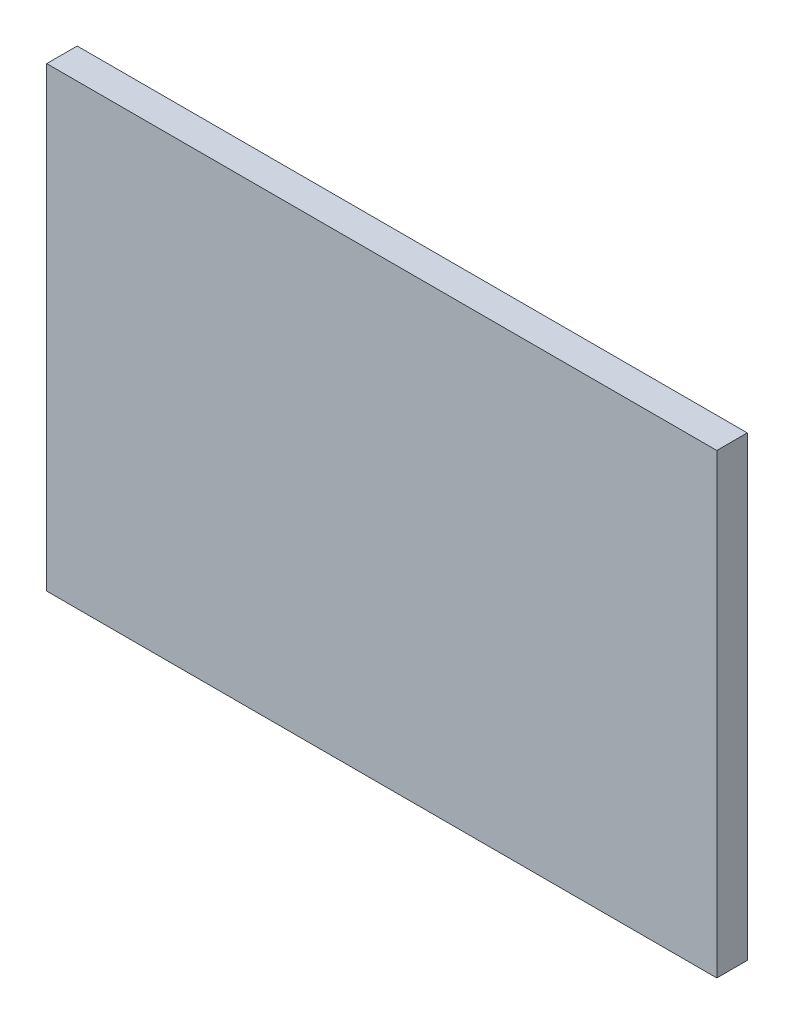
ISO-10303-21;
HEADER;
FILE_DESCRIPTION(('STEP AP214'),'2;1');
FILE_NAME('part.step','',(''),(''),'','','');
FILE_SCHEMA(('AUTOMOTIVE_DESIGN { 1 0 10303 214 1 1 1 1 }'));
ENDSEC;
DATA;
#1=APPLICATION_CONTEXT('core data for automotive mechanical design processes');
#2=APPLICATION_PROTOCOL_DEFINITION('international standard','automotive_design',2000,#1);
#3=PRODUCT_CONTEXT('',#1,'mechanical');
#4=PRODUCT('Part','Part','',(#3));
#5=PRODUCT_RELATED_PRODUCT_CATEGORY('part','',(#4));
#6=PRODUCT_DEFINITION_FORMATION('','',#4);
#7=PRODUCT_DEFINITION_CONTEXT('part definition',#1,'design');
#8=PRODUCT_DEFINITION('design','',#6,#7);
#9=PRODUCT_DEFINITION_SHAPE('','',#8);
#10=(LENGTH_UNIT() NAMED_UNIT(*) SI_UNIT(.MILLI.,.METRE.));
#11=(NAMED_UNIT(*) PLANE_ANGLE_UNIT() SI_UNIT($,.RADIAN.));
#12=(NAMED_UNIT(*) SI_UNIT($,.STERADIAN.) SOLID_ANGLE_UNIT());
#13=UNCERTAINTY_MEASURE_WITH_UNIT(LENGTH_MEASURE(1.E-05),#10,'distance_accuracy_value','');
#14=(GEOMETRIC_REPRESENTATION_CONTEXT(3) GLOBAL_UNCERTAINTY_ASSIGNED_CONTEXT((#13)) GLOBAL_UNIT_ASSIGNED_CONTEXT((#10,
#11,#12)) REPRESENTATION_CONTEXT('',''));
#15=CARTESIAN_POINT('',(0.,0.,0.));
#16=DIRECTION('',(0.,0.,1.));
#17=DIRECTION('',(1.,0.,0.));
#18=AXIS2_PLACEMENT_3D('',#15,#16,#17);
#19=CARTESIAN_POINT('',(11.,14.9411637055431,1.));
#20=DIRECTION('',(0.,-1.,0.));
#21=DIRECTION('',(0.,0.,-1.));
#22=AXIS2_PLACEMENT_3D('',#19,#20,#21);
#23=PLANE('',#22);
#24=DIRECTION('',(-1.,0.,0.));
#25=VECTOR('',#24,1.);
#26=CARTESIAN_POINT('',(11.,14.9411637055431,0.));
#27=LINE('',#26,#25);
#28=CARTESIAN_POINT('',(11.,14.9411637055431,0.));
#29=VERTEX_POINT('',#28);
#30=CARTESIAN_POINT('',(-11.,14.9411637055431,0.));
#31=VERTEX_POINT('',#30);
#32=EDGE_CURVE('E80',#29,#31,#27,.T.);
#33=ORIENTED_EDGE('',*,*,#32,.T.);
#34=DIRECTION('',(0.,0.,-1.));
#35=VECTOR('',#34,1.);
#36=CARTESIAN_POINT('',(-11.,14.9411637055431,1.));
#37=LINE('',#36,#35);
#38=CARTESIAN_POINT('',(-11.,14.9411637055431,1.));
#39=VERTEX_POINT('',#38);
#40=EDGE_CURVE('E11',#39,#31,#37,.T.);
#41=ORIENTED_EDGE('',*,*,#40,.F.);
#42=DIRECTION('',(-1.,0.,0.));
#43=VECTOR('',#42,1.);
#44=CARTESIAN_POINT('',(11.,14.9411637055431,1.));
#45=LINE('',#44,#43);
#46=CARTESIAN_POINT('',(11.,14.9411637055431,1.));
#47=VERTEX_POINT('',#46);
#48=EDGE_CURVE('E98',#47,#39,#45,.T.);
#49=ORIENTED_EDGE('',*,*,#48,.F.);
#50=DIRECTION('',(0.,0.,-1.));
#51=VECTOR('',#50,1.);
#52=CARTESIAN_POINT('',(11.,14.9411637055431,1.));
#53=LINE('',#52,#51);
#54=EDGE_CURVE('E92',#47,#29,#53,.T.);
#55=ORIENTED_EDGE('',*,*,#54,.T.);
#56=EDGE_LOOP('',(#33,#41,#49,#55));
#57=FACE_BOUND('',#56,.T.);
#58=ADVANCED_FACE('F36',(#57),#23,.F.);
#59=CARTESIAN_POINT('',(-11.,14.9411637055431,1.));
#60=DIRECTION('',(1.,0.,0.));
#61=DIRECTION('',(0.,0.,-1.));
#62=AXIS2_PLACEMENT_3D('',#59,#60,#61);
#63=PLANE('',#62);
#64=DIRECTION('',(0.,-1.,0.));
#65=VECTOR('',#64,1.);
#66=CARTESIAN_POINT('',(-11.,14.9411637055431,0.));
#67=LINE('',#66,#65);
#68=CARTESIAN_POINT('',(-11.,-0.0588362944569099,0.));
#69=VERTEX_POINT('',#68);
#70=EDGE_CURVE('E76',#31,#69,#67,.T.);
#71=ORIENTED_EDGE('',*,*,#70,.T.);
#72=DIRECTION('',(0.,0.,-1.));
#73=VECTOR('',#72,1.);
#74=CARTESIAN_POINT('',(-11.,-0.0588362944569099,1.));
#75=LINE('',#74,#73);
#76=CARTESIAN_POINT('',(-11.,-0.0588362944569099,1.));
#77=VERTEX_POINT('',#76);
#78=EDGE_CURVE('E43',#77,#69,#75,.T.);
#79=ORIENTED_EDGE('',*,*,#78,.F.);
#80=DIRECTION('',(0.,-1.,0.));
#81=VECTOR('',#80,1.);
#82=CARTESIAN_POINT('',(-11.,14.9411637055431,1.));
#83=LINE('',#82,#81);
#84=EDGE_CURVE('E88',#39,#77,#83,.T.);
#85=ORIENTED_EDGE('',*,*,#84,.F.);
#86=ORIENTED_EDGE('',*,*,#40,.T.);
#87=EDGE_LOOP('',(#71,#79,#85,#86));
#88=FACE_BOUND('',#87,.T.);
#89=ADVANCED_FACE('F87',(#88),#63,.F.);
#90=CARTESIAN_POINT('',(-11.,-0.0588362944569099,1.));
#91=DIRECTION('',(0.,1.,0.));
#92=DIRECTION('',(0.,0.,1.));
#93=AXIS2_PLACEMENT_3D('',#90,#91,#92);
#94=PLANE('',#93);
#95=DIRECTION('',(1.,0.,0.));
#96=VECTOR('',#95,1.);
#97=CARTESIAN_POINT('',(-11.,-0.0588362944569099,0.));
#98=LINE('',#97,#96);
#99=CARTESIAN_POINT('',(11.,-0.0588362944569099,0.));
#100=VERTEX_POINT('',#99);
#101=EDGE_CURVE('E81',#69,#100,#98,.T.);
#102=ORIENTED_EDGE('',*,*,#101,.T.);
#103=DIRECTION('',(0.,0.,-1.));
#104=VECTOR('',#103,1.);
#105=CARTESIAN_POINT('',(11.,-0.0588362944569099,1.));
#106=LINE('',#105,#104);
#107=CARTESIAN_POINT('',(11.,-0.0588362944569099,1.));
#108=VERTEX_POINT('',#107);
#109=EDGE_CURVE('E104',#108,#100,#106,.T.);
#110=ORIENTED_EDGE('',*,*,#109,.F.);
#111=DIRECTION('',(1.,0.,0.));
#112=VECTOR('',#111,1.);
#113=CARTESIAN_POINT('',(-11.,-0.0588362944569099,1.));
#114=LINE('',#113,#112);
#115=EDGE_CURVE('E55',#77,#108,#114,.T.);
#116=ORIENTED_EDGE('',*,*,#115,.F.);
#117=ORIENTED_EDGE('',*,*,#78,.T.);
#118=EDGE_LOOP('',(#102,#110,#116,#117));
#119=FACE_BOUND('',#118,.T.);
#120=ADVANCED_FACE('F107',(#119),#94,.F.);
#121=CARTESIAN_POINT('',(11.,14.9411637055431,1.));
#122=DIRECTION('',(-1.,0.,0.));
#123=DIRECTION('',(0.,0.,1.));
#124=AXIS2_PLACEMENT_3D('',#121,#122,#123);
#125=PLANE('',#124);
#126=DIRECTION('',(0.,1.,0.));
#127=VECTOR('',#126,1.);
#128=CARTESIAN_POINT('',(11.,14.9411637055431,0.));
#129=LINE('',#128,#127);
#130=EDGE_CURVE('E96',#100,#29,#129,.T.);
#131=ORIENTED_EDGE('',*,*,#130,.T.);
#132=ORIENTED_EDGE('',*,*,#54,.F.);
#133=DIRECTION('',(0.,1.,0.));
#134=VECTOR('',#133,1.);
#135=CARTESIAN_POINT('',(11.,14.9411637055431,1.));
#136=LINE('',#135,#134);
#137=EDGE_CURVE('E50',#108,#47,#136,.T.);
#138=ORIENTED_EDGE('',*,*,#137,.F.);
#139=ORIENTED_EDGE('',*,*,#109,.T.);
#140=EDGE_LOOP('',(#131,#132,#138,#139));
#141=FACE_BOUND('',#140,.T.);
#142=ADVANCED_FACE('F109',(#141),#125,.F.);
#143=CARTESIAN_POINT('',(-11.,14.9411637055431,1.));
#144=DIRECTION('',(0.,0.,1.));
#145=DIRECTION('',(1.,0.,0.));
#146=AXIS2_PLACEMENT_3D('',#143,#144,#145);
#147=PLANE('',#146);
#148=ORIENTED_EDGE('',*,*,#48,.T.);
#149=ORIENTED_EDGE('',*,*,#84,.T.);
#150=ORIENTED_EDGE('',*,*,#115,.T.);
#151=ORIENTED_EDGE('',*,*,#137,.T.);
#152=EDGE_LOOP('',(#148,#149,#150,#151));
#153=FACE_BOUND('',#152,.T.);
#154=ADVANCED_FACE('F110',(#153),#147,.T.);
#155=CARTESIAN_POINT('',(-11.,14.9411637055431,0.));
#156=DIRECTION('',(0.,0.,1.));
#157=DIRECTION('',(1.,0.,0.));
#158=AXIS2_PLACEMENT_3D('',#155,#156,#157);
#159=PLANE('',#158);
#160=ORIENTED_EDGE('',*,*,#32,.F.);
#161=ORIENTED_EDGE('',*,*,#130,.F.);
#162=ORIENTED_EDGE('',*,*,#101,.F.);
#163=ORIENTED_EDGE('',*,*,#70,.F.);
#164=EDGE_LOOP('',(#160,#161,#162,#163));
#165=FACE_BOUND('',#164,.T.);
#166=ADVANCED_FACE('F77',(#165),#159,.F.);
#167=CLOSED_SHELL('',(#58,#89,#120,#142,#154,#166));
#168=MANIFOLD_SOLID_BREP('B2',#167);
#169=ADVANCED_BREP_SHAPE_REPRESENTATION('',(#18,#168),#14);
#170=SHAPE_DEFINITION_REPRESENTATION(#9,#169);
ENDSEC;
END-ISO-10303-21;
